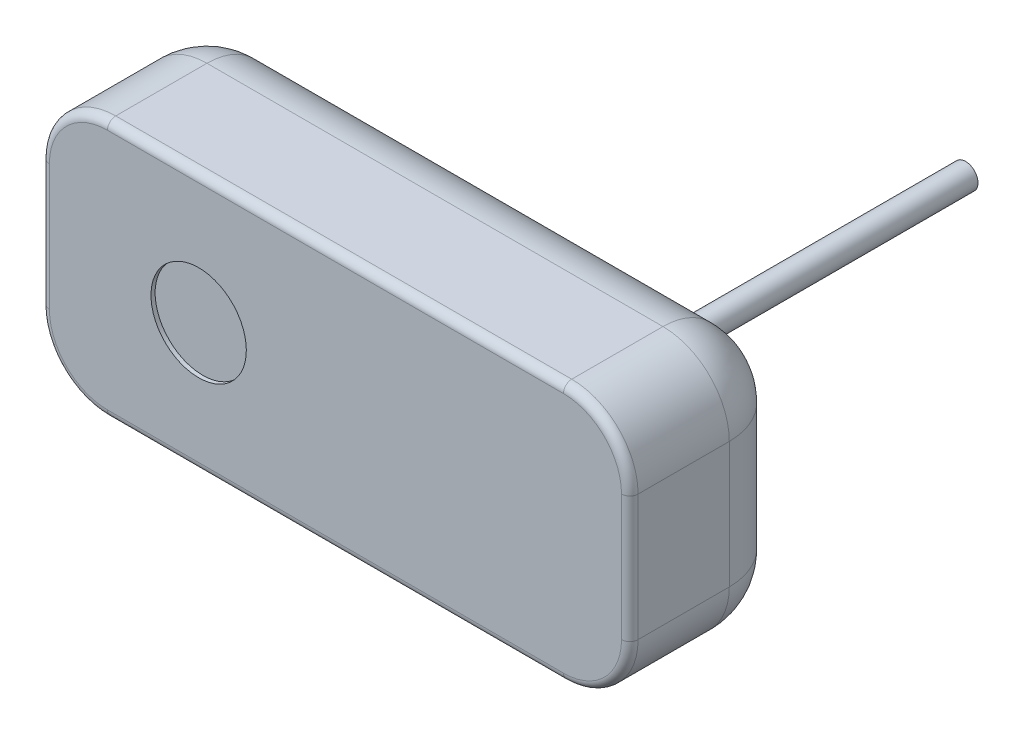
from build123d import *

# Parameters (mm, degrees)
SKETCH_1_W                  = 71
SKETCH_1_H                  = 31.2
EXTRUDE_1_DEPTH             = 20
FILLET_1_R                  = 8
FILLET_2_R                  = 8
FILLET_3_R                  = 1
SKETCH_2_R                  = 5.75
CUT_EXTRUDE_1_DEPTH         = 0.5
EXTRUDE_2_DEPTH             = 3.5
SKETCH_4_R                  = 1.5
EXTRUDE_3_DEPTH             = 33
EXTRUDE_3_DIRECTION_2_REACH = 45.63


with BuildPart() as part:
    # Sketch 1 → Extrude 1 (new body)
    with BuildSketch(Plane.XY):
        Rectangle(SKETCH_1_W, SKETCH_1_H)
    extrude(amount=EXTRUDE_1_DEPTH)

    # Fillet 1
    fillet_1_edges = [part.edges().sort_by_distance(p)[0] for p in [
        (-35.5, -15.6, 10),
        (35.5, -15.6, 10),
        (35.5, 15.6, 10),
        (-35.5, 15.6, 10),
    ]]
    fillet(fillet_1_edges, radius=FILLET_1_R)

    # Fillet 2
    fillet_2_edges = [part.edges().sort_by_distance(p)[0] for p in [
        (35.5, 0, 0),
        (-35.5, 0, 0),
        (0, 15.6, 0),
        (0, -15.6, 0),
        (-33.156854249, 13.256854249, 0),
        (33.156854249, 13.256854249, 0),
        (-33.156854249, -13.256854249, 0),
        (33.156854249, -13.256854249, 0),
    ]]
    fillet(fillet_2_edges, radius=FILLET_2_R)

    # Fillet 3
    fillet_3_edges = [part.edges().sort_by_distance(p)[0] for p in [
        (35.5, 0, 20),
        (0, -15.6, 20),
        (-35.5, 0, 20),
        (0, 15.6, 20),
        (-33.156854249, 13.256854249, 20),
        (33.156854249, 13.256854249, 20),
        (-33.156854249, -13.256854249, 20),
        (33.156854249, -13.256854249, 20),
    ]]
    fillet(fillet_3_edges, radius=FILLET_3_R)

    # Sketch 2 → Cut-Extrude 1 (cut)
    with BuildSketch(Plane.XY.offset(20)):
        with Locations((-16.5, 0)):
            Circle(SKETCH_2_R)
    extrude(amount=-CUT_EXTRUDE_1_DEPTH, mode=Mode.SUBTRACT)

    # Sketch 3 → Extrude 2 (add, symmetric)
    with BuildSketch(Plane(origin=(-10, 0, 0), x_dir=(0, 0, -1), z_dir=(1, 0, 0))):
        with BuildLine():
            Line((0, 3), (3.5, 3))
            ThreePointArc((3.5, 3), (6.5, 0), (3.5, -3))
            Line((3.5, -3), (0, -3))
            Line((0, -3), (0, 3))
        make_face()
    extrude(amount=EXTRUDE_2_DEPTH, both=True)

    # Sketch 4 → Extrude 3 (add)
    with BuildSketch(Plane(origin=(0, 0, 0), x_dir=(-1, 0, 0), z_dir=(0, 0, -1))):
        with Locations((-23, 8.6)):
            Circle(SKETCH_4_R)
    extrude(amount=EXTRUDE_3_DEPTH)

    # Sketch 4 → Extrude 3 direction 2 (add, up to next)
    with BuildSketch(Plane(origin=(0, 0, 0), x_dir=(-1, 0, 0), z_dir=(0, 0, -1)), mode=Mode.PRIVATE) as extrude_3_direction_2_sk1:
        with Locations((-23, 8.6)):
            Circle(SKETCH_4_R)
    extrude_3_direction_2_tool1 = extrude(extrude_3_direction_2_sk1.sketch, amount=-EXTRUDE_3_DIRECTION_2_REACH, mode=Mode.PRIVATE) - part.part
    add(extrude_3_direction_2_tool1.solids().sort_by_distance((23, 8.6, 0))[0])


solid = part.part
